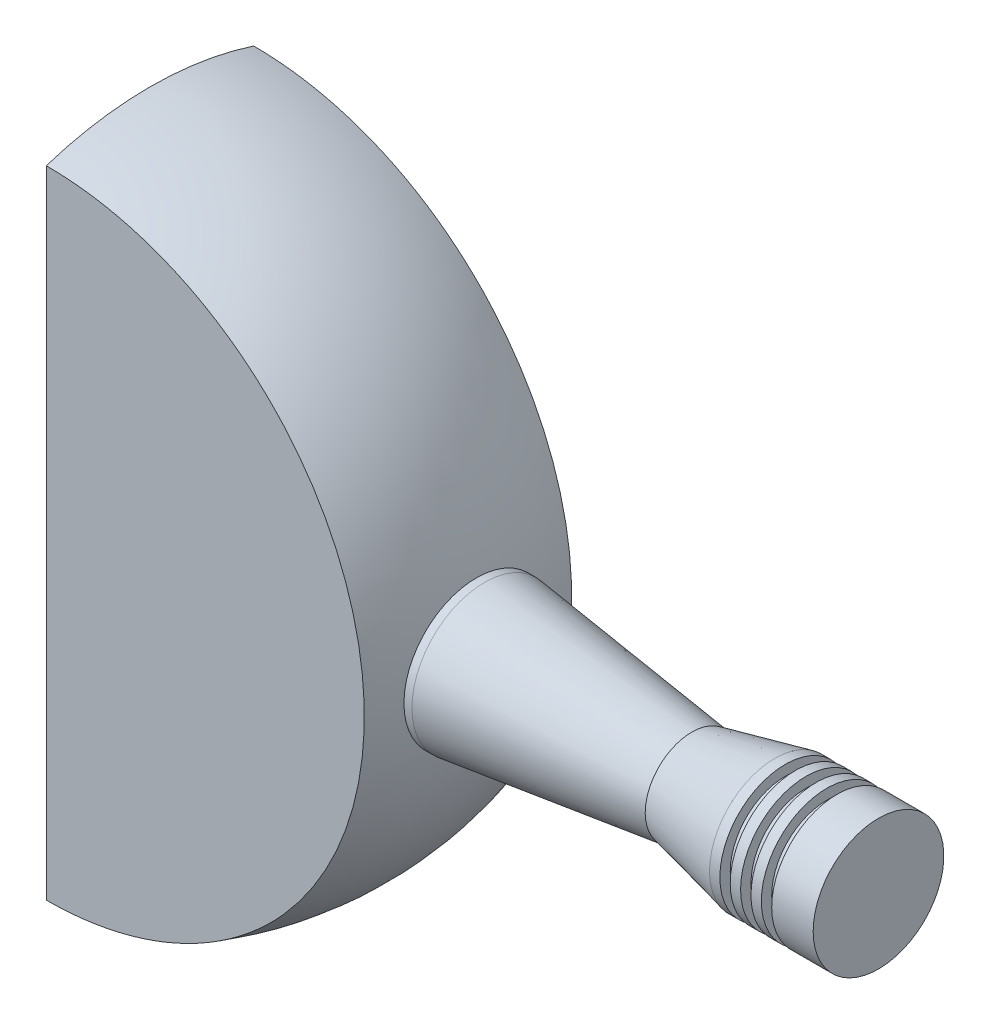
from build123d import *
from build123d.topology import SkipClean

# Parameters (mm, degrees)
ENL_V_MAT_EXTRU_1_DEPTH      = 28.937979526
ENL_V_MAT_EXTRU_1_DEPTH_BACK = 28.937979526
ESQUISSE5_OUTSIDE_W          = 45.776
ESQUISSE5_OUTSIDE_H          = 45.776
ESQUISSE5_OUTSIDE_W_2        = 10
ESQUISSE5_OUTSIDE_H_2        = 34.183491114
ENL_V_MAT_EXTRU_2_DEPTH      = 40


with BuildPart() as part:
    # Esquisse1 → R_volution5 (revolve)
    with BuildSketch(Plane.XY):
        with BuildLine():
            Line((0, 16.13), (0, -16.13))
            ThreePointArc((0, -16.13), (16.13, 0), (0, 16.13))
        make_face()
    revolve(axis=Axis((0, 23.195581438, 0), (0, -1, 0)))

    # Esquisse2 → Enl_v. mat.-Extru.1 (cut, two sides: drawn at the far end of the back side and taken through both)
    with SkipClean():  # the faces are left unmerged after this step: merging them gives an invalid solid
        with BuildSketch(Plane.XY.offset(-ENL_V_MAT_EXTRU_1_DEPTH_BACK)):
            Polygon((0, 98.265552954), (0, 16.13), (0, -16.13), (0, -98.265552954), (-164.271105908, -98.265552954), (-164.271105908, 98.265552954), align=None)
        extrude(amount=ENL_V_MAT_EXTRU_1_DEPTH + ENL_V_MAT_EXTRU_1_DEPTH_BACK, mode=Mode.SUBTRACT)

    # Esquisse4 → R_volution6 (revolve)
    with SkipClean():  # the faces are left unmerged after this step: merging them gives an invalid solid
        with BuildSketch(Plane.XY, mode=Mode.PRIVATE) as r_volution6_sk:
            Polygon((15.157131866, 0), (35.13, 0), (35.13, 3.15), (33.13, 3.15), (33.13, 2.65), (32.63, 2.65), (32.63, 3.15), (32.13, 3.15), (32.13, 2.65), (31.63, 2.65), (31.63, 3.15), (31.13, 3.15), (31.13, 2.65), (30.63, 2.65), (30.63, 3.15), (30.13, 3.15), (26.13, 2.25), (16.13, 3.5), (15.157131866, 3.5), align=None)
        revolve(r_volution6_sk.sketch.rotate(Axis((0, 0, 0), (1, 0, 0)), 90), axis=Axis((0, 0, 0), (1, 0, 0)))

    # Esquisse5 outside → Enl_v. mat.-Extru.2 (cut, symmetric)
    with BuildSketch(Plane(origin=(0, 0, 0), x_dir=(0, 0, -1), z_dir=(1, 0, 0))):
        Rectangle(ESQUISSE5_OUTSIDE_W, ESQUISSE5_OUTSIDE_H)
        with Locations((0, 0.02678957)):
            Rectangle(ESQUISSE5_OUTSIDE_W_2, ESQUISSE5_OUTSIDE_H_2, mode=Mode.SUBTRACT)
    extrude(amount=ENL_V_MAT_EXTRU_2_DEPTH, both=True, mode=Mode.SUBTRACT)


solid = part.part
